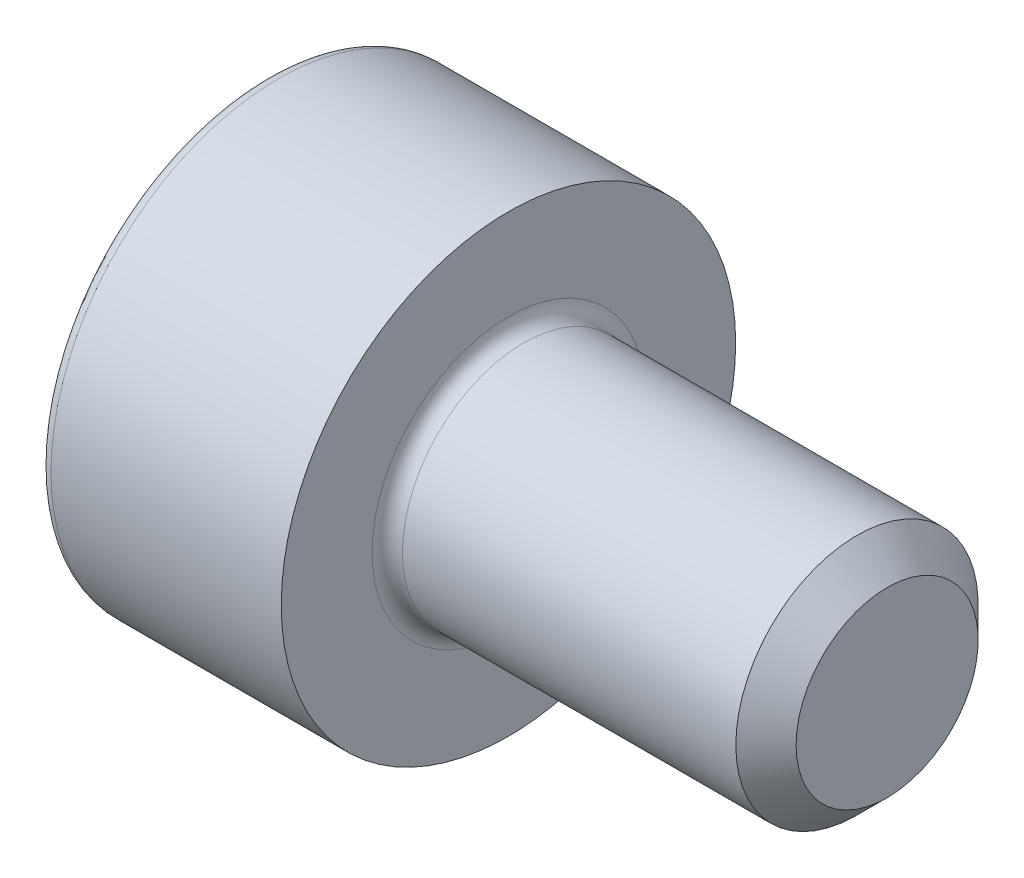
from build123d import *

# Parameters (mm, degrees)
FILLET1_R   = 0.1
FILLET2_R   = 0.08
HEX_2_DEPTH = 0.7


with BuildPart() as part:
    # BodySke → BaseBody (revolve)
    with BuildSketch(Plane.XY, mode=Mode.PRIVATE) as basebody_sk:
        Polygon((0, 0), (0, 1.5), (1.6, 1.5), (1.6, 0.8), (3.901, 0.8), (4.1, 0.601), (4.1, 0), align=None)
    revolve(basebody_sk.sketch.rotate(Axis((0, 0, 0), (1, 0, 0)), 90), axis=Axis((0, 0, 0), (1, 0, 0)))

    # Fillet1
    fillet1_edges = [part.edges().sort_by_distance(p)[0] for p in [
        (1.6, 0, -0.8),
    ]]
    fillet(fillet1_edges, radius=FILLET1_R)

    # Fillet2
    fillet2_edges = [part.edges().sort_by_distance(p)[0] for p in [
        (0, 0, -1.5),
    ]]
    fillet(fillet2_edges, radius=FILLET2_R)

    # HexSke → Hex 2 (cut)
    with BuildSketch(Plane(origin=(0, 0, 0), x_dir=(0, 0, -1), z_dir=(1, 0, 0))):
        Polygon((0, 0.866025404), (-0.75, 0.433012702), (-0.75, -0.433012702), (0, -0.866025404), (0.75, -0.433012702), (0.75, 0.433012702), align=None)
    extrude(amount=HEX_2_DEPTH, mode=Mode.SUBTRACT)

    # Hex-PreBroachSke → Hex-PreBroach (revolve, cut)
    with BuildSketch(Plane.XY, mode=Mode.PRIVATE) as hex_prebroach_sk:
        Polygon((0, 0), (0, 0.75), (0.7, 0.75), (1.133012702, 0), align=None)
    revolve(hex_prebroach_sk.sketch.rotate(Axis((0, 0, 0), (1, 0, 0)), 270), axis=Axis((0, 0, 0), (1, 0, 0)), mode=Mode.SUBTRACT)


solid = part.part
